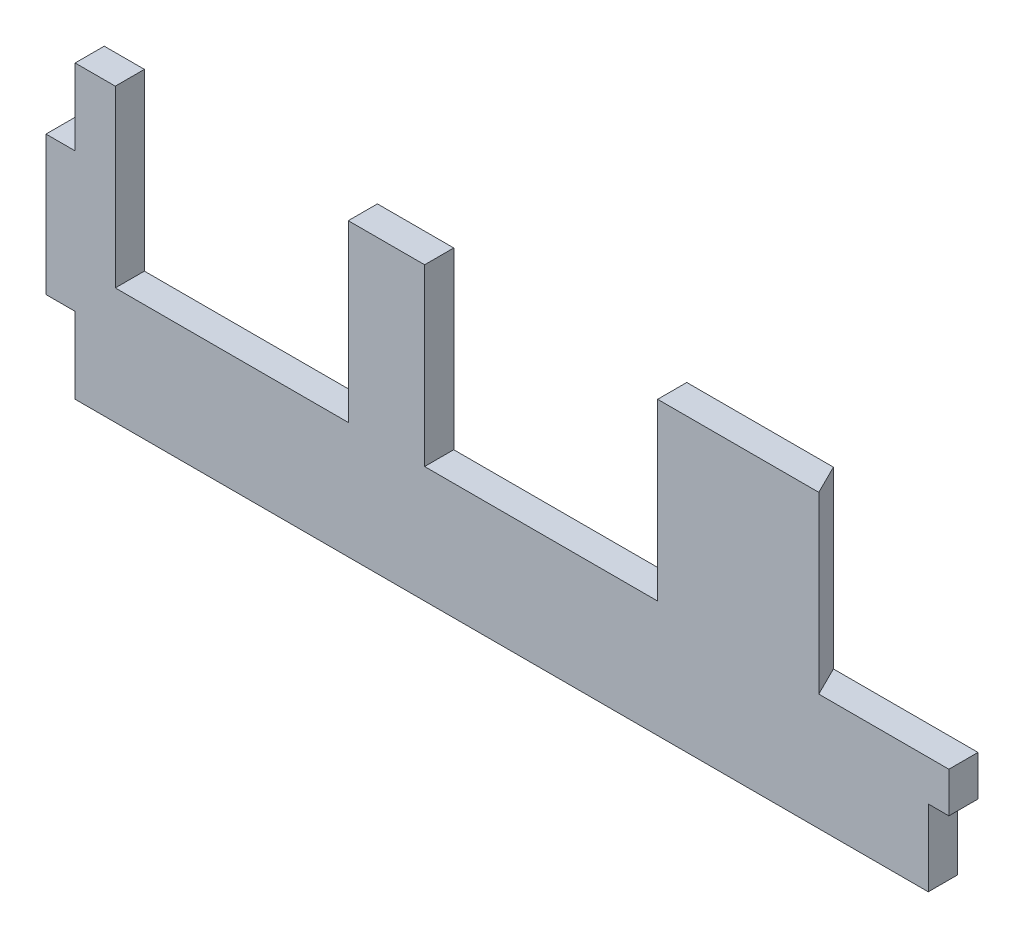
from build123d import *

# Parameters (mm, degrees)
EXTRUDE1_DEPTH     = 12.7
SKETCH3_W          = 101.6
SKETCH3_H          = 12.7
CUT_EXTRUDE1_DEPTH = 76.2


with BuildPart() as part:
    # Sketch2 → Extrude1 (new body)
    with BuildSketch(Plane.XY):
        Polygon((393.7, 127), (393.7, 33.190544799), (384.719743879, 33.190544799), (384.719743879, 0), (12.7, 0), (12.7, 33.190544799), (0, 33.190544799), (0, 93.809455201), (12.7, 93.809455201), (12.7, 127), align=None)
    extrude(amount=-EXTRUDE1_DEPTH)

    # Sketch3 → Cut-Extrude1 (cut)
    with BuildSketch(Plane(origin=(0, 127, 0), x_dir=(1, 0, 0), z_dir=(0, 1, 0))):
        with Locations((215.9, 6.35)):
            Rectangle(SKETCH3_W, SKETCH3_H)
        Polygon((330.657977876, 12.7), (393.7, 12.7), (393.7, 0), (336.970592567, 0), align=None)
        with Locations((81.009231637, 6.35)):
            Rectangle(SKETCH3_W, SKETCH3_H)
    extrude(amount=-CUT_EXTRUDE1_DEPTH, mode=Mode.SUBTRACT)


solid = part.part
